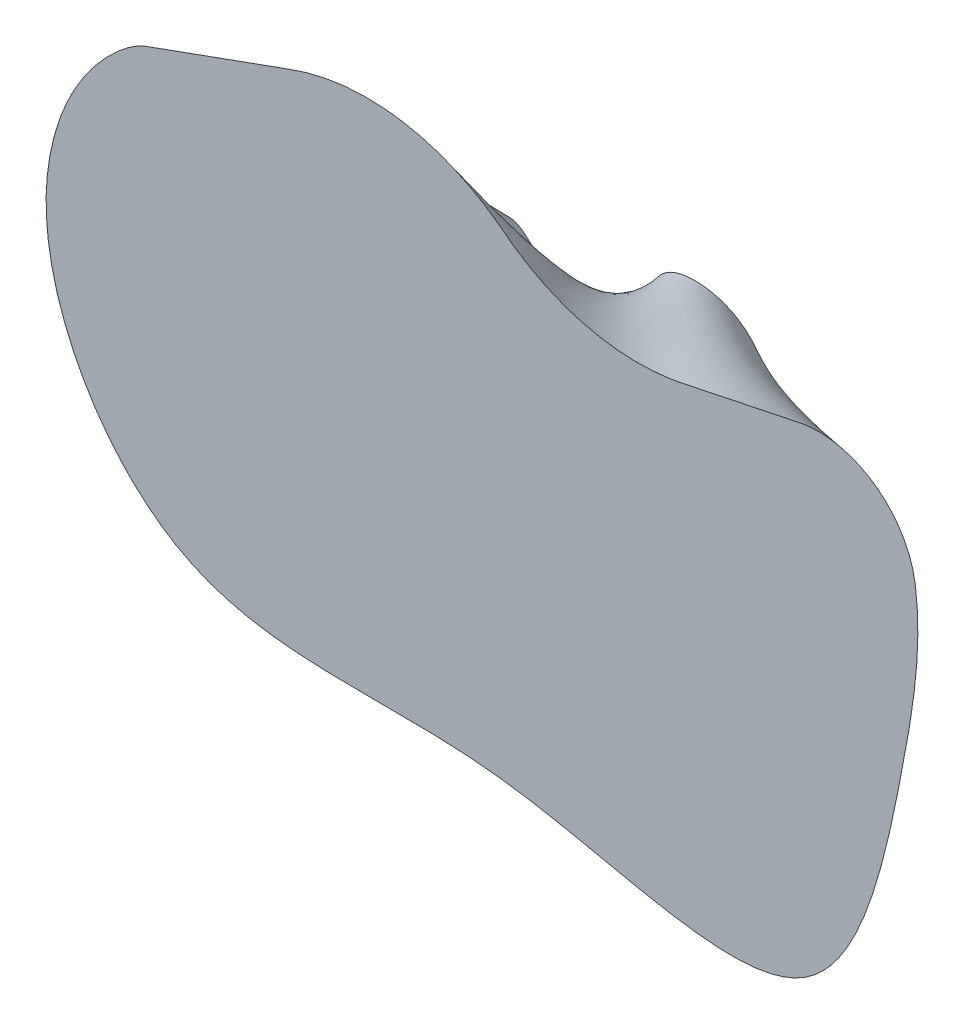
ISO-10303-21;
HEADER;
FILE_DESCRIPTION(('STEP AP214'),'2;1');
FILE_NAME('part.step','',(''),(''),'','','');
FILE_SCHEMA(('AUTOMOTIVE_DESIGN { 1 0 10303 214 1 1 1 1 }'));
ENDSEC;
DATA;
#1=APPLICATION_CONTEXT('core data for automotive mechanical design processes');
#2=APPLICATION_PROTOCOL_DEFINITION('international standard','automotive_design',2000,#1);
#3=PRODUCT_CONTEXT('',#1,'mechanical');
#4=PRODUCT('Part','Part','',(#3));
#5=PRODUCT_RELATED_PRODUCT_CATEGORY('part','',(#4));
#6=PRODUCT_DEFINITION_FORMATION('','',#4);
#7=PRODUCT_DEFINITION_CONTEXT('part definition',#1,'design');
#8=PRODUCT_DEFINITION('design','',#6,#7);
#9=PRODUCT_DEFINITION_SHAPE('','',#8);
#10=(LENGTH_UNIT() NAMED_UNIT(*) SI_UNIT(.MILLI.,.METRE.));
#11=(NAMED_UNIT(*) PLANE_ANGLE_UNIT() SI_UNIT($,.RADIAN.));
#12=(NAMED_UNIT(*) SI_UNIT($,.STERADIAN.) SOLID_ANGLE_UNIT());
#13=UNCERTAINTY_MEASURE_WITH_UNIT(LENGTH_MEASURE(1.E-05),#10,'distance_accuracy_value','');
#14=(GEOMETRIC_REPRESENTATION_CONTEXT(3) GLOBAL_UNCERTAINTY_ASSIGNED_CONTEXT((#13)) GLOBAL_UNIT_ASSIGNED_CONTEXT((#10,
#11,#12)) REPRESENTATION_CONTEXT('',''));
#15=CARTESIAN_POINT('',(0.,0.,0.));
#16=DIRECTION('',(0.,0.,1.));
#17=DIRECTION('',(1.,0.,0.));
#18=AXIS2_PLACEMENT_3D('',#15,#16,#17);
#19=CARTESIAN_POINT('',(62.032029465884,-18.982039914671,0.));
#20=DIRECTION('',(0.,0.,-1.));
#21=DIRECTION('',(-1.,0.,0.));
#22=AXIS2_PLACEMENT_3D('',#19,#20,#21);
#23=PLANE('',#22);
#24=CARTESIAN_POINT('',(0.,0.,0.));
#25=CARTESIAN_POINT('',(1.91795518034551,-4.35446976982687,0.));
#26=CARTESIAN_POINT('',(6.30072846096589,-18.5535667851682,0.));
#27=CARTESIAN_POINT('',(-16.9889802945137,-4.36226777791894,0.));
#28=CARTESIAN_POINT('',(-45.5005409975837,3.96144688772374,0.));
#29=CARTESIAN_POINT('',(-20.6115536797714,-40.2818270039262,0.));
#30=CARTESIAN_POINT('',(17.4986218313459,-16.6241039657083,0.));
#31=CARTESIAN_POINT('',(60.6304605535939,-28.9684286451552,0.));
#32=CARTESIAN_POINT('',(83.5111808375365,5.39639836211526,0.));
#33=CARTESIAN_POINT('',(76.1282959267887,38.2090206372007,0.));
#34=CARTESIAN_POINT('',(48.2545931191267,39.7281601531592,0.));
#35=CARTESIAN_POINT('',(45.5588898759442,20.5152375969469,0.));
#36=CARTESIAN_POINT('',(23.6452538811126,11.1723902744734,0.));
#37=CARTESIAN_POINT('',(13.2980058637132,37.2161252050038,0.));
#38=CARTESIAN_POINT('',(-8.99995761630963,14.8469507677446,0.));
#39=CARTESIAN_POINT('',(-2.22606613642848,5.05399594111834,0.));
#40=CARTESIAN_POINT('',(0.,0.,0.));
#41=B_SPLINE_CURVE_WITH_KNOTS('',3,(#24,#25,#26,#27,#28,#29,#30,#31,#32,#33,#34,#35,#36,#37,#38,
#39,#40),.UNSPECIFIED.,.T.,.F.,(4,1,1,1,1,1,1,1,1,1,1,1,1,1,4),(0.,0.0363930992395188,
0.0971845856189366,0.159988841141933,0.232415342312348,0.372484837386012,0.490008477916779,
0.595575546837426,0.683637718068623,0.738080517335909,0.779750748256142,0.838469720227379,
0.889902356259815,0.957760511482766,1.),.UNSPECIFIED.);
#42=CARTESIAN_POINT('',(0.,0.,0.));
#43=VERTEX_POINT('',#42);
#44=EDGE_CURVE('E53',#43,#43,#41,.T.);
#45=ORIENTED_EDGE('',*,*,#44,.F.);
#46=EDGE_LOOP('',(#45));
#47=FACE_BOUND('',#46,.T.);
#48=ADVANCED_FACE('F43',(#47),#23,.T.);
#49=CARTESIAN_POINT('',(-34.5385029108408,-53.0491766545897,35.));
#50=DIRECTION('',(0.,0.,1.));
#51=DIRECTION('',(1.,0.,0.));
#52=AXIS2_PLACEMENT_3D('',#49,#50,#51);
#53=PLANE('',#52);
#54=CARTESIAN_POINT('',(121.000806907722,55.4564577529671,35.));
#55=CARTESIAN_POINT('',(120.881071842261,55.4368727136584,35.));
#56=CARTESIAN_POINT('',(120.641887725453,55.3959540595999,35.));
#57=CARTESIAN_POINT('',(120.283598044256,55.3310610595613,35.));
#58=CARTESIAN_POINT('',(120.046073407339,55.2814396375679,35.));
#59=CARTESIAN_POINT('',(119.92731108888,55.2566289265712,35.));
#60=CARTESIAN_POINT('',(119.84001996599,55.2383928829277,35.));
#61=CARTESIAN_POINT('',(119.665437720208,55.2019207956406,35.));
#62=CARTESIAN_POINT('',(119.403564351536,55.1472126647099,35.));
#63=CARTESIAN_POINT('',(119.228982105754,55.1107405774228,35.));
#64=CARTESIAN_POINT('',(119.141690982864,55.0925045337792,35.));
#65=CARTESIAN_POINT('',(110.575549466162,53.3029464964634,35.));
#66=CARTESIAN_POINT('',(102.009407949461,51.5133884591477,35.));
#67=CARTESIAN_POINT('',(93.4432664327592,49.7238304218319,35.));
#68=CARTESIAN_POINT('',(93.1017272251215,49.652479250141,35.));
#69=CARTESIAN_POINT('',(92.4186488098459,49.5097769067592,35.));
#70=CARTESIAN_POINT('',(91.3940311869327,49.2957233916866,35.));
#71=CARTESIAN_POINT('',(90.7109527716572,49.1530210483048,35.));
#72=CARTESIAN_POINT('',(90.3694135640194,49.0816698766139,35.));
#73=CARTESIAN_POINT('',(90.02723855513,49.0101858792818,35.));
#74=CARTESIAN_POINT('',(89.3428885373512,48.8672178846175,35.));
#75=CARTESIAN_POINT('',(88.3088274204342,48.6886072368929,35.));
#76=CARTESIAN_POINT('',(87.6184168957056,48.5783692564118,35.));
#77=CARTESIAN_POINT('',(87.2727181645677,48.5265417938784,35.));
#78=CARTESIAN_POINT('',(72.4583921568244,46.3055648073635,35.));
#79=CARTESIAN_POINT('',(57.9382633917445,49.9883429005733,35.));
#80=CARTESIAN_POINT('',(45.9732624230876,59.001430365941,35.));
#81=CARTESIAN_POINT('',(45.7204672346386,59.1918578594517,35.));
#82=CARTESIAN_POINT('',(45.2181600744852,59.5770713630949,35.));
#83=CARTESIAN_POINT('',(44.4741468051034,60.1671330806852,35.));
#84=CARTESIAN_POINT('',(43.9703200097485,60.5503556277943,35.));
#85=CARTESIAN_POINT('',(43.7168000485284,60.7398171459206,35.));
#86=CARTESIAN_POINT('',(28.8239465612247,71.8696020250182,35.));
#87=CARTESIAN_POINT('',(10.4779570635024,74.8852057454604,35.));
#88=CARTESIAN_POINT('',(-7.19393036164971,69.108217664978,35.));
#89=CARTESIAN_POINT('',(-7.3758170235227,69.0487584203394,35.));
#90=CARTESIAN_POINT('',(-7.73898065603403,68.9279748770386,35.));
#91=CARTESIAN_POINT('',(-8.28257060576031,68.7430463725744,35.));
#92=CARTESIAN_POINT('',(-8.64251409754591,68.6129951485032,35.));
#93=CARTESIAN_POINT('',(-8.8224858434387,68.5479695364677,35.));
#94=CARTESIAN_POINT('',(-8.94624096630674,68.5032555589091,35.));
#95=CARTESIAN_POINT('',(-9.19375121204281,68.4138276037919,35.));
#96=CARTESIAN_POINT('',(-9.56501658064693,68.2796856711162,35.));
#97=CARTESIAN_POINT('',(-9.812526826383,68.190257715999,35.));
#98=CARTESIAN_POINT('',(-9.93628194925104,68.1455437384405,35.));
#99=CARTESIAN_POINT('',(-21.4790970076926,63.9750079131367,35.));
#100=CARTESIAN_POINT('',(-33.0219120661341,59.8044720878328,35.));
#101=CARTESIAN_POINT('',(-44.5647271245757,55.6339362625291,35.));
#102=CARTESIAN_POINT('',(-44.681733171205,55.5916607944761,35.));
#103=CARTESIAN_POINT('',(-44.9157452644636,55.5071098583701,35.));
#104=CARTESIAN_POINT('',(-45.2667634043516,55.3802834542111,35.));
#105=CARTESIAN_POINT('',(-45.5007754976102,55.2957325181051,35.));
#106=CARTESIAN_POINT('',(-45.6177815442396,55.2534570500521,35.));
#107=CARTESIAN_POINT('',(-45.6883128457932,55.2279733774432,35.));
#108=CARTESIAN_POINT('',(-45.8293754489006,55.1770060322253,35.));
#109=CARTESIAN_POINT('',(-46.0394153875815,55.0961092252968,35.));
#110=CARTESIAN_POINT('',(-46.1782222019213,55.0392849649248,35.));
#111=CARTESIAN_POINT('',(-46.2476256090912,55.0108728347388,35.));
#112=CARTESIAN_POINT('',(-46.3015218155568,54.988808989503,35.));
#113=CARTESIAN_POINT('',(-46.409314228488,54.9446812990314,35.));
#114=CARTESIAN_POINT('',(-46.5697991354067,54.8755437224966,35.));
#115=CARTESIAN_POINT('',(-46.6764636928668,54.8287520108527,35.));
#116=CARTESIAN_POINT('',(-46.7296784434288,54.8050918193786,35.));
#117=CARTESIAN_POINT('',(-49.1813361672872,53.715042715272,35.));
#118=CARTESIAN_POINT('',(-64.1283465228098,42.4677312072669,35.));
#119=CARTESIAN_POINT('',(-81.016757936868,0.353338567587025,35.));
#120=CARTESIAN_POINT('',(-38.7889854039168,-70.117674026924,35.));
#121=CARTESIAN_POINT('',(40.2784653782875,-50.6991088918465,35.));
#122=CARTESIAN_POINT('',(129.377142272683,-88.1710362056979,35.));
#123=CARTESIAN_POINT('',(145.58788763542,-14.3284713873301,35.));
#124=CARTESIAN_POINT('',(151.166544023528,18.7212796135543,35.));
#125=CARTESIAN_POINT('',(150.043285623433,31.2926539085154,35.));
#126=CARTESIAN_POINT('',(149.986829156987,31.9245079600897,35.));
#127=CARTESIAN_POINT('',(149.857361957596,33.1867369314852,35.));
#128=CARTESIAN_POINT('',(149.612319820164,35.0811900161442,35.));
#129=CARTESIAN_POINT('',(149.34984236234,36.323429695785,35.));
#130=CARTESIAN_POINT('',(149.195115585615,36.938642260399,35.));
#131=CARTESIAN_POINT('',(145.867596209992,50.1692657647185,35.));
#132=CARTESIAN_POINT('',(134.464530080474,57.6587161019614,35.));
#133=CARTESIAN_POINT('',(121.000806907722,55.4564577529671,35.));
#134=(BOUNDED_CURVE() B_SPLINE_CURVE(3,(#54,#55,#56,#57,#58,#59,#60,#61,#62,#63,#64,#65,#66,#67,
#68,#69,#70,#71,#72,#73,#74,#75,#76,#77,#78,#79,#80,#81,#82,#83,#84,#85,#86,#87,#88,#89,#90,#91,
#92,#93,#94,#95,#96,#97,#98,#99,#100,#101,#102,#103,#104,#105,#106,#107,#108,#109,#110,#111,
#112,#113,#114,#115,#116,#117,#118,#119,#120,#121,#122,#123,#124,#125,#126,#127,#128,#129,#130,
#131,#132,#133),.UNSPECIFIED.,.T.,.F.) B_SPLINE_CURVE_WITH_KNOTS((4,1,1,3,1,1,3,3,1,1,3,1,1,3,3,
1,1,3,3,1,1,3,1,1,3,3,1,1,3,1,1,3,1,1,3,1,1,1,1,1,1,3,1,1,3,4),(0.,0.000606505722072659,
0.00121301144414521,0.00181951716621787,0.0022653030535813,0.00271108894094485,
0.0031568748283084,0.0469031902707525,0.0486473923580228,0.0503915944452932,0.0521357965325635,
0.0538832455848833,0.055630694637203,0.0573781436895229,0.128375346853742,0.129957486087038,
0.131539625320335,0.133121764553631,0.219093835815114,0.220050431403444,0.221007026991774,
0.221963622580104,0.22262141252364,0.223279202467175,0.223936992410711,0.28528998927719,
0.285911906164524,0.286533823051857,0.28715573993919,0.28753063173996,0.287905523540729,
0.288280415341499,0.288571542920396,0.288862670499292,0.289153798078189,0.302566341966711,
0.381001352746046,0.491478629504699,0.63218258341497,0.761153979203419,0.865475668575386,
0.931365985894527,0.934677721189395,0.937989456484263,0.941301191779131,1.),
.UNSPECIFIED.) CURVE() GEOMETRIC_REPRESENTATION_ITEM() RATIONAL_B_SPLINE_CURVE((1.,1.,1.,1.,1.,
1.,1.,1.,1.,1.,1.,1.,1.,1.,1.,1.,1.,1.,1.,1.,1.,1.,1.,1.,0.948096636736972,0.948096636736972,1.,
1.,1.,1.,1.,1.,0.925011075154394,0.925011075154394,1.,1.,1.,1.,1.,1.,1.,1.,1.,1.,1.,1.,1.,1.,1.,
1.,1.,1.,1.,1.,1.,1.,1.,1.,1.,1.,1.,1.,1.,1.,1.,1.,1.,1.,1.,1.,1.,1.,1.,1.,1.,1.,1.,
0.824173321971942,0.824173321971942,1.)) REPRESENTATION_ITEM(''));
#135=CARTESIAN_POINT('',(121.000806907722,55.4564577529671,35.));
#136=VERTEX_POINT('',#135);
#137=EDGE_CURVE('E11',#136,#136,#134,.T.);
#138=ORIENTED_EDGE('',*,*,#137,.T.);
#139=EDGE_LOOP('',(#138));
#140=FACE_BOUND('',#139,.T.);
#141=ADVANCED_FACE('F100',(#140),#53,.T.);
#142=CARTESIAN_POINT('',(-32.8870227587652,59.8532089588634,35.));
#143=CARTESIAN_POINT('',(3.41789013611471,25.3715556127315,0.));
#144=CARTESIAN_POINT('',(-27.1809691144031,61.914863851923,35.));
#145=CARTESIAN_POINT('',(6.39082750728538,27.7890423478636,0.));
#146=CARTESIAN_POINT('',(-19.224870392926,64.7889409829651,35.));
#147=CARTESIAN_POINT('',(11.0482258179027,29.7509468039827,0.));
#148=CARTESIAN_POINT('',(-11.2692320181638,67.6642850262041,35.));
#149=CARTESIAN_POINT('',(14.5570137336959,27.6196009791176,0.));
#150=CARTESIAN_POINT('',(-7.48795436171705,69.0312312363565,35.));
#151=CARTESIAN_POINT('',(16.1465938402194,26.2806321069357,0.));
#152=CARTESIAN_POINT('',(-5.93635212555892,69.5300816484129,35.));
#153=CARTESIAN_POINT('',(16.7688727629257,25.6484355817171,0.));
#154=CARTESIAN_POINT('',(1.5155716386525,71.5292926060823,35.));
#155=CARTESIAN_POINT('',(19.6823623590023,22.4273237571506,0.));
#156=CARTESIAN_POINT('',(8.05428844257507,72.1873563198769,35.));
#157=CARTESIAN_POINT('',(22.0241765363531,19.0078506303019,0.));
#158=CARTESIAN_POINT('',(18.7519560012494,71.4004367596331,35.));
#159=CARTESIAN_POINT('',(27.109663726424,16.2270524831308,0.));
#160=CARTESIAN_POINT('',(29.5013235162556,69.2445083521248,34.9999999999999));
#161=CARTESIAN_POINT('',(33.2216401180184,15.689185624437,0.));
#162=CARTESIAN_POINT('',(38.9442411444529,64.3427190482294,35.));
#163=CARTESIAN_POINT('',(39.2644281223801,18.9697339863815,0.));
#164=CARTESIAN_POINT('',(44.3559845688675,60.2583508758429,35.));
#165=CARTESIAN_POINT('',(42.1456821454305,21.8831614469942,0.));
#166=CARTESIAN_POINT('',(44.7709012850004,59.9309552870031,34.9999999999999));
#167=CARTESIAN_POINT('',(42.3635295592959,22.1154907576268,0.));
#168=CARTESIAN_POINT('',(45.9549852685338,59.0043671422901,35.0000000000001));
#169=CARTESIAN_POINT('',(42.9623881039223,22.7902716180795,0.));
#170=CARTESIAN_POINT('',(51.2436552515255,55.091413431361,35.0000000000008));
#171=CARTESIAN_POINT('',(45.413266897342,25.8534747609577,0.));
#172=CARTESIAN_POINT('',(59.8542169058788,50.8503415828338,35.0000000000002));
#173=CARTESIAN_POINT('',(47.0586186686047,31.2041638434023,0.));
#174=CARTESIAN_POINT('',(72.0695058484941,48.0457860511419,35.0000000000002));
#175=CARTESIAN_POINT('',(50.4601376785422,36.4839875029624,0.));
#176=CARTESIAN_POINT('',(78.9959460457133,47.7721801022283,35.0000000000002));
#177=CARTESIAN_POINT('',(53.9224289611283,37.8294915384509,0.));
#178=CARTESIAN_POINT('',(85.4377253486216,48.2286923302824,34.9999999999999));
#179=CARTESIAN_POINT('',(57.5299202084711,38.3538673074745,0.));
#180=CARTESIAN_POINT('',(87.8983801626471,48.5638532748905,35.0000000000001));
#181=CARTESIAN_POINT('',(59.0004936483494,38.3791954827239,0.));
#182=CARTESIAN_POINT('',(94.8887264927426,50.0257884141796,34.9999999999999));
#183=CARTESIAN_POINT('',(63.2772176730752,37.99319959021,0.));
#184=CARTESIAN_POINT('',(104.321585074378,51.996675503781,35.));
#185=CARTESIAN_POINT('',(69.1438248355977,36.3063653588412,0.));
#186=CARTESIAN_POINT('',(113.754598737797,53.9668397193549,35.0000000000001));
#187=CARTESIAN_POINT('',(73.1121154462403,32.6831202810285,0.));
#188=CARTESIAN_POINT('',(118.969676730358,55.0567799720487,34.9999999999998));
#189=CARTESIAN_POINT('',(74.8205983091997,30.2999753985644,0.));
#190=CARTESIAN_POINT('',(119.318033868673,55.1267236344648,35.0000000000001));
#191=CARTESIAN_POINT('',(74.9322163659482,30.1392436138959,0.));
#192=CARTESIAN_POINT('',(123.021234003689,55.9330794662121,34.9999999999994));
#193=CARTESIAN_POINT('',(76.0984266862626,28.4059570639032,0.));
#194=CARTESIAN_POINT('',(129.112174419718,55.9952596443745,35.));
#195=CARTESIAN_POINT('',(77.5616462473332,25.3934805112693,0.));
#196=CARTESIAN_POINT('',(136.255413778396,53.3954318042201,35.));
#197=CARTESIAN_POINT('',(78.6557271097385,21.1782782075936,0.));
#198=CARTESIAN_POINT('',(141.527175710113,49.8305945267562,35.));
#199=CARTESIAN_POINT('',(79.1741607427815,17.4670584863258,0.));
#200=CARTESIAN_POINT('',(146.120717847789,44.871963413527,35.0000000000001));
#201=CARTESIAN_POINT('',(79.340482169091,13.4412761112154,0.));
#202=CARTESIAN_POINT('',(148.725184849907,39.2816029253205,35.0000000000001));
#203=CARTESIAN_POINT('',(79.0529764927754,9.75493488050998,0.));
#204=CARTESIAN_POINT('',(149.593102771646,35.1814739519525,35.0000000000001));
#205=CARTESIAN_POINT('',(78.6506169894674,7.25908501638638,0.));
#206=CARTESIAN_POINT('',(150.494733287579,28.2577328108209,35.0000000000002));
#207=CARTESIAN_POINT('',(77.8672094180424,3.12563679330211,0.));
#208=CARTESIAN_POINT('',(150.439361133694,15.1382542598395,35.0000000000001));
#209=CARTESIAN_POINT('',(75.4281355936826,-4.33521840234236,0.));
#210=CARTESIAN_POINT('',(148.320454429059,2.5900518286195,34.9999999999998));
#211=CARTESIAN_POINT('',(71.4100392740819,-10.4833387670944,0.));
#212=CARTESIAN_POINT('',(145.776870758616,-11.0902084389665,35.0000000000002));
#213=CARTESIAN_POINT('',(66.2611961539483,-16.1468716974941,0.));
#214=CARTESIAN_POINT('',(144.341672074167,-18.5323052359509,34.9999999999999));
#215=CARTESIAN_POINT('',(63.0581350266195,-18.6543672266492,0.));
#216=CARTESIAN_POINT('',(141.61818176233,-29.9580533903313,35.));
#217=CARTESIAN_POINT('',(57.6387336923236,-21.1966330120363,0.));
#218=CARTESIAN_POINT('',(139.572950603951,-37.4747528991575,35.0000000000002));
#219=CARTESIAN_POINT('',(53.862774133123,-22.2975997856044,0.));
#220=CARTESIAN_POINT('',(135.936944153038,-47.500868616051,34.9999999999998));
#221=CARTESIAN_POINT('',(48.3953568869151,-22.9617757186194,0.));
#222=CARTESIAN_POINT('',(132.055743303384,-55.2904283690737,35.));
#223=CARTESIAN_POINT('',(43.7584525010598,-23.0521857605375,0.));
#224=CARTESIAN_POINT('',(127.850319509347,-60.9388119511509,35.0000000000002));
#225=CARTESIAN_POINT('',(39.9031144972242,-22.9539640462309,0.));
#226=CARTESIAN_POINT('',(124.242721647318,-64.4587839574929,35.0000000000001));
#227=CARTESIAN_POINT('',(37.1031250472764,-22.8492789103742,0.));
#228=CARTESIAN_POINT('',(120.947588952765,-66.7759543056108,35.));
#229=CARTESIAN_POINT('',(34.8493909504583,-22.7589878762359,0.));
#230=CARTESIAN_POINT('',(115.872086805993,-69.1953214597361,34.9999999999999));
#231=CARTESIAN_POINT('',(31.675268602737,-22.6486200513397,0.));
#232=CARTESIAN_POINT('',(108.949428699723,-70.7549739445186,34.9999999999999));
#233=CARTESIAN_POINT('',(27.6573907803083,-22.5750266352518,0.));
#234=CARTESIAN_POINT('',(101.767045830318,-70.861899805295,34.9999999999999));
#235=CARTESIAN_POINT('',(23.5442619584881,-22.7239192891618,0.));
#236=CARTESIAN_POINT('',(95.9348561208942,-70.4477983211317,35.));
#237=CARTESIAN_POINT('',(20.1866478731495,-23.0568526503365,0.));
#238=CARTESIAN_POINT('',(90.3263987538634,-69.7860166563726,35.));
#239=CARTESIAN_POINT('',(16.9491578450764,-23.5372983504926,0.));
#240=CARTESIAN_POINT('',(82.4642130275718,-68.454478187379,34.9999999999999));
#241=CARTESIAN_POINT('',(12.3925100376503,-24.4882602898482,0.));
#242=CARTESIAN_POINT('',(67.620004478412,-65.3479799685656,35.0000000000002));
#243=CARTESIAN_POINT('',(3.79107136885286,-26.7185880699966,0.));
#244=CARTESIAN_POINT('',(55.5206518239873,-62.6514593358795,35.));
#245=CARTESIAN_POINT('',(-3.07866732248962,-28.5079614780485,0.));
#246=CARTESIAN_POINT('',(39.9554011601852,-60.5050320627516,35.));
#247=CARTESIAN_POINT('',(-11.5485744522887,-29.2276516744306,0.));
#248=CARTESIAN_POINT('',(28.5546225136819,-59.8300347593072,35.));
#249=CARTESIAN_POINT('',(-17.555966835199,-28.8591592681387,0.));
#250=CARTESIAN_POINT('',(16.6798503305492,-59.8100963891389,35.0000000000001));
#251=CARTESIAN_POINT('',(-23.486009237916,-25.7678455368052,0.));
#252=CARTESIAN_POINT('',(6.72641116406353,-59.791453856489,35.0000000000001));
#253=CARTESIAN_POINT('',(-28.3193807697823,-21.9198852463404,0.));
#254=CARTESIAN_POINT('',(-2.87579841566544,-59.7350972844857,35.0000000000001));
#255=CARTESIAN_POINT('',(-32.8332816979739,-16.8269450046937,0.));
#256=CARTESIAN_POINT('',(-15.2931350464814,-58.7403195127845,34.9999999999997));
#257=CARTESIAN_POINT('',(-36.859677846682,-9.64762741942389,0.));
#258=CARTESIAN_POINT('',(-24.6012936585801,-56.8421501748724,35.0000000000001));
#259=CARTESIAN_POINT('',(-38.0368258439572,-5.03531249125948,0.));
#260=CARTESIAN_POINT('',(-29.9712675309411,-55.0161043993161,35.));
#261=CARTESIAN_POINT('',(-37.6585933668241,-3.07234184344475,0.));
#262=CARTESIAN_POINT('',(-33.9781781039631,-53.3587655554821,35.));
#263=CARTESIAN_POINT('',(-36.9505050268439,-1.92471684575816,0.));
#264=CARTESIAN_POINT('',(-39.6667362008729,-50.5747979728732,35.));
#265=CARTESIAN_POINT('',(-35.3162909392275,-0.769522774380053,0.));
#266=CARTESIAN_POINT('',(-47.9620543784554,-44.4660514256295,34.9999999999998));
#267=CARTESIAN_POINT('',(-30.4870429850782,-0.861250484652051,0.));
#268=CARTESIAN_POINT('',(-55.3148297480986,-36.424493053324,35.));
#269=CARTESIAN_POINT('',(-23.3827422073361,-3.04834207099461,0.));
#270=CARTESIAN_POINT('',(-59.7736599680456,-29.9493647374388,34.9999999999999));
#271=CARTESIAN_POINT('',(-17.7909508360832,-5.40122523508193,0.));
#272=CARTESIAN_POINT('',(-64.3603970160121,-22.1564268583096,34.9999999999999));
#273=CARTESIAN_POINT('',(-11.3523064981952,-8.40430803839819,0.));
#274=CARTESIAN_POINT('',(-69.3096568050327,-10.6881484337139,35.0000000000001));
#275=CARTESIAN_POINT('',(-2.82117450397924,-12.7981773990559,0.));
#276=CARTESIAN_POINT('',(-71.3980814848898,1.20307541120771,35.0000000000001));
#277=CARTESIAN_POINT('',(2.07578307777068,-13.5237545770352,0.));
#278=CARTESIAN_POINT('',(-71.4667529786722,7.75946232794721,35.));
#279=CARTESIAN_POINT('',(2.73779553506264,-11.4317712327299,0.));
#280=CARTESIAN_POINT('',(-71.432288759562,15.1943965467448,34.9999999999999));
#281=CARTESIAN_POINT('',(3.29632805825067,-8.83182028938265,0.));
#282=CARTESIAN_POINT('',(-69.7276310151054,24.8635710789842,35.0000000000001));
#283=CARTESIAN_POINT('',(1.13433456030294,-2.01974301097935,0.));
#284=CARTESIAN_POINT('',(-64.7435749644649,36.0027707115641,35.0000000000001));
#285=CARTESIAN_POINT('',(-2.1796485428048,4.51535585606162,0.));
#286=CARTESIAN_POINT('',(-60.1221821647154,43.3151452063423,34.9999999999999));
#287=CARTESIAN_POINT('',(-4.02895878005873,8.76785659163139,0.));
#288=CARTESIAN_POINT('',(-56.1773148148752,47.7287906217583,35.0000000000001));
#289=CARTESIAN_POINT('',(-4.43794360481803,11.6726575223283,0.));
#290=CARTESIAN_POINT('',(-51.9642803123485,51.5642015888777,35.));
#291=CARTESIAN_POINT('',(-3.99804910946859,14.6852311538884,0.));
#292=CARTESIAN_POINT('',(-50.0685051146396,53.0518957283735,35.));
#293=CARTESIAN_POINT('',(-3.56493587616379,16.0143847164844,0.));
#294=CARTESIAN_POINT('',(-47.1935914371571,54.6214101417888,35.));
#295=CARTESIAN_POINT('',(-2.72270038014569,17.8212709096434,0.));
#296=CARTESIAN_POINT('',(-46.3114546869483,55.006297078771,35.));
#297=CARTESIAN_POINT('',(-2.44514665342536,18.3502749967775,0.));
#298=CARTESIAN_POINT('',(-41.2328246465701,56.834653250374,34.9999999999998));
#299=CARTESIAN_POINT('',(-0.734408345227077,21.294729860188,0.));
#300=CARTESIAN_POINT('',(-37.0604489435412,58.3453078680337,35.));
#301=CARTESIAN_POINT('',(1.24347407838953,23.6033979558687,0.));
#302=CARTESIAN_POINT('',(-32.8870227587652,59.8532089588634,35.));
#303=CARTESIAN_POINT('',(3.41789013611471,25.3715556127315,0.));
#304=B_SPLINE_SURFACE_WITH_KNOTS('',3,1,((#142,#143),(#144,#145),(#146,#147),(#148,#149),(#150,
#151),(#152,#153),(#154,#155),(#156,#157),(#158,#159),(#160,#161),(#162,#163),(#164,#165),(#166,
#167),(#168,#169),(#170,#171),(#172,#173),(#174,#175),(#176,#177),(#178,#179),(#180,#181),(#182,
#183),(#184,#185),(#186,#187),(#188,#189),(#190,#191),(#192,#193),(#194,#195),(#196,#197),(#198,
#199),(#200,#201),(#202,#203),(#204,#205),(#206,#207),(#208,#209),(#210,#211),(#212,#213),(#214,
#215),(#216,#217),(#218,#219),(#220,#221),(#222,#223),(#224,#225),(#226,#227),(#228,#229),(#230,
#231),(#232,#233),(#234,#235),(#236,#237),(#238,#239),(#240,#241),(#242,#243),(#244,#245),(#246,
#247),(#248,#249),(#250,#251),(#252,#253),(#254,#255),(#256,#257),(#258,#259),(#260,#261),(#262,
#263),(#264,#265),(#266,#267),(#268,#269),(#270,#271),(#272,#273),(#274,#275),(#276,#277),(#278,
#279),(#280,#281),(#282,#283),(#284,#285),(#286,#287),(#288,#289),(#290,#291),(#292,#293),(#294,
#295),(#296,#297),(#298,#299),(#300,#301),(#302,#303)),.UNSPECIFIED.,.T.,.F.,.F.,(4,1,2,2,1,1,1,
2,2,1,1,1,2,2,1,2,2,1,1,1,1,1,1,1,1,2,1,1,1,1,1,1,1,1,1,1,1,1,1,1,1,2,1,1,1,1,1,1,1,1,1,1,1,1,1,
1,1,2,1,1,1,1,1,2,2,4),(2,2),(0.,0.0296976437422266,0.0414072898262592,0.0493788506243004,
0.0791697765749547,0.0811302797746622,0.101889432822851,0.132489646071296,0.135076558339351,
0.139849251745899,0.167269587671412,0.181519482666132,0.201005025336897,0.213132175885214,
0.235962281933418,0.260301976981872,0.262041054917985,0.278853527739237,0.291240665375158,
0.298822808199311,0.309868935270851,0.324024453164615,0.328565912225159,0.330354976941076,
0.358192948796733,0.392507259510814,0.426305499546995,0.429591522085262,0.449993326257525,
0.464417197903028,0.48174450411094,0.492438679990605,0.498764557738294,0.50636308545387,
0.512071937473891,0.52621850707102,0.540810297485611,0.547115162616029,0.554831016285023,
0.568441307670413,0.586136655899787,0.629063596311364,0.663045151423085,0.684892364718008,
0.687184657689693,0.711757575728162,0.731886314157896,0.748083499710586,0.758153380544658,
0.759611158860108,0.769302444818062,0.789095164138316,0.809754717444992,0.822415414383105,
0.827526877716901,0.854001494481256,0.883206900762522,0.886101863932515,0.919600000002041,
0.933407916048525,0.945720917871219,0.961839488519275,0.962253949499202,0.973579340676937,
0.978279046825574,1.),(0.,1.),.UNSPECIFIED.);
#305=ORIENTED_EDGE('',*,*,#137,.F.);
#306=EDGE_LOOP('',(#305));
#307=FACE_BOUND('',#306,.T.);
#308=ORIENTED_EDGE('',*,*,#44,.T.);
#309=EDGE_LOOP('',(#308));
#310=FACE_BOUND('',#309,.T.);
#311=ADVANCED_FACE('F83',(#307,#310),#304,.T.);
#312=CLOSED_SHELL('',(#48,#141,#311));
#313=MANIFOLD_SOLID_BREP('B2',#312);
#314=ADVANCED_BREP_SHAPE_REPRESENTATION('',(#18,#313),#14);
#315=SHAPE_DEFINITION_REPRESENTATION(#9,#314);
ENDSEC;
END-ISO-10303-21;
